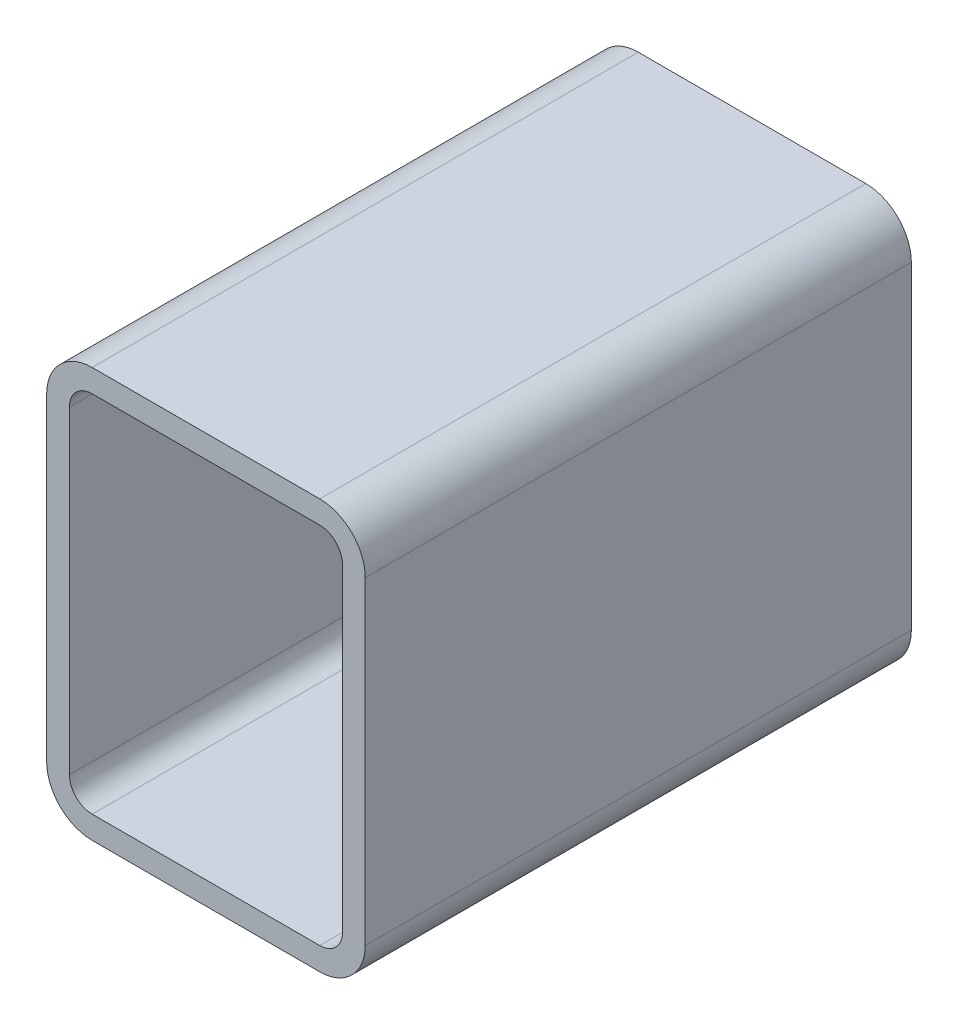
ISO-10303-21;
HEADER;
FILE_DESCRIPTION(('STEP AP214'),'2;1');
FILE_NAME('part.step','',(''),(''),'','','');
FILE_SCHEMA(('AUTOMOTIVE_DESIGN { 1 0 10303 214 1 1 1 1 }'));
ENDSEC;
DATA;
#1=APPLICATION_CONTEXT('core data for automotive mechanical design processes');
#2=APPLICATION_PROTOCOL_DEFINITION('international standard','automotive_design',2000,#1);
#3=PRODUCT_CONTEXT('',#1,'mechanical');
#4=PRODUCT('Part','Part','',(#3));
#5=PRODUCT_RELATED_PRODUCT_CATEGORY('part','',(#4));
#6=PRODUCT_DEFINITION_FORMATION('','',#4);
#7=PRODUCT_DEFINITION_CONTEXT('part definition',#1,'design');
#8=PRODUCT_DEFINITION('design','',#6,#7);
#9=PRODUCT_DEFINITION_SHAPE('','',#8);
#10=(LENGTH_UNIT() NAMED_UNIT(*) SI_UNIT(.MILLI.,.METRE.));
#11=(NAMED_UNIT(*) PLANE_ANGLE_UNIT() SI_UNIT($,.RADIAN.));
#12=(NAMED_UNIT(*) SI_UNIT($,.STERADIAN.) SOLID_ANGLE_UNIT());
#13=UNCERTAINTY_MEASURE_WITH_UNIT(LENGTH_MEASURE(1.E-05),#10,'distance_accuracy_value','');
#14=(GEOMETRIC_REPRESENTATION_CONTEXT(3) GLOBAL_UNCERTAINTY_ASSIGNED_CONTEXT((#13)) GLOBAL_UNIT_ASSIGNED_CONTEXT((#10,
#11,#12)) REPRESENTATION_CONTEXT('',''));
#15=CARTESIAN_POINT('',(0.,0.,0.));
#16=DIRECTION('',(0.,0.,1.));
#17=DIRECTION('',(1.,0.,0.));
#18=AXIS2_PLACEMENT_3D('',#15,#16,#17);
#19=CARTESIAN_POINT('',(27.6048786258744,205.143222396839,304.8));
#20=DIRECTION('',(0.,0.,1.));
#21=DIRECTION('',(1.,0.,0.));
#22=AXIS2_PLACEMENT_3D('',#19,#20,#21);
#23=PLANE('',#22);
#24=CARTESIAN_POINT('',(27.6048786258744,205.143222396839,304.8));
#25=DIRECTION('',(0.,0.,1.));
#26=DIRECTION('',(1.,0.,0.));
#27=AXIS2_PLACEMENT_3D('',#24,#25,#26);
#28=CIRCLE('',#27,25.4);
#29=CARTESIAN_POINT('',(27.6048786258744,230.543222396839,304.8));
#30=VERTEX_POINT('',#29);
#31=CARTESIAN_POINT('',(2.20487862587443,205.143222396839,304.8));
#32=VERTEX_POINT('',#31);
#33=EDGE_CURVE('E211',#30,#32,#28,.T.);
#34=ORIENTED_EDGE('',*,*,#33,.T.);
#35=DIRECTION('',(0.,-1.,0.));
#36=VECTOR('',#35,1.);
#37=CARTESIAN_POINT('',(2.20487862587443,27.3432223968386,304.8));
#38=LINE('',#37,#36);
#39=CARTESIAN_POINT('',(2.20487862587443,27.3432223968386,304.8));
#40=VERTEX_POINT('',#39);
#41=EDGE_CURVE('E214',#32,#40,#38,.T.);
#42=ORIENTED_EDGE('',*,*,#41,.T.);
#43=CARTESIAN_POINT('',(27.6048786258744,27.3432223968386,304.8));
#44=DIRECTION('',(0.,0.,1.));
#45=DIRECTION('',(1.,0.,0.));
#46=AXIS2_PLACEMENT_3D('',#43,#44,#45);
#47=CIRCLE('',#46,25.4);
#48=CARTESIAN_POINT('',(27.6048786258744,1.94322239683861,304.8));
#49=VERTEX_POINT('',#48);
#50=EDGE_CURVE('E217',#40,#49,#47,.T.);
#51=ORIENTED_EDGE('',*,*,#50,.T.);
#52=DIRECTION('',(1.,0.,0.));
#53=VECTOR('',#52,1.);
#54=CARTESIAN_POINT('',(154.604878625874,1.94322239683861,304.8));
#55=LINE('',#54,#53);
#56=CARTESIAN_POINT('',(154.604878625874,1.94322239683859,304.8));
#57=VERTEX_POINT('',#56);
#58=EDGE_CURVE('E219',#49,#57,#55,.T.);
#59=ORIENTED_EDGE('',*,*,#58,.T.);
#60=CARTESIAN_POINT('',(154.604878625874,27.3432223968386,304.8));
#61=DIRECTION('',(0.,0.,1.));
#62=DIRECTION('',(1.,0.,0.));
#63=AXIS2_PLACEMENT_3D('',#60,#61,#62);
#64=CIRCLE('',#63,25.4);
#65=CARTESIAN_POINT('',(180.004878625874,27.3432223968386,304.8));
#66=VERTEX_POINT('',#65);
#67=EDGE_CURVE('E221',#57,#66,#64,.T.);
#68=ORIENTED_EDGE('',*,*,#67,.T.);
#69=DIRECTION('',(0.,1.,0.));
#70=VECTOR('',#69,1.);
#71=CARTESIAN_POINT('',(180.004878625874,205.143222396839,304.8));
#72=LINE('',#71,#70);
#73=CARTESIAN_POINT('',(180.004878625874,205.143222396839,304.8));
#74=VERTEX_POINT('',#73);
#75=EDGE_CURVE('E223',#66,#74,#72,.T.);
#76=ORIENTED_EDGE('',*,*,#75,.T.);
#77=CARTESIAN_POINT('',(154.604878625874,205.143222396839,304.8));
#78=DIRECTION('',(0.,0.,1.));
#79=DIRECTION('',(1.,0.,0.));
#80=AXIS2_PLACEMENT_3D('',#77,#78,#79);
#81=CIRCLE('',#80,25.4);
#82=CARTESIAN_POINT('',(154.604878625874,230.543222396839,304.8));
#83=VERTEX_POINT('',#82);
#84=EDGE_CURVE('E225',#74,#83,#81,.T.);
#85=ORIENTED_EDGE('',*,*,#84,.T.);
#86=DIRECTION('',(-1.,0.,0.));
#87=VECTOR('',#86,1.);
#88=CARTESIAN_POINT('',(27.6048786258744,230.543222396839,304.8));
#89=LINE('',#88,#87);
#90=EDGE_CURVE('E227',#83,#30,#89,.T.);
#91=ORIENTED_EDGE('',*,*,#90,.T.);
#92=EDGE_LOOP('',(#34,#42,#51,#59,#68,#76,#85,#91));
#93=FACE_BOUND('',#92,.T.);
#94=DIRECTION('',(0.,-1.,0.));
#95=VECTOR('',#94,1.);
#96=CARTESIAN_POINT('',(14.9048786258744,27.3432223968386,304.8));
#97=LINE('',#96,#95);
#98=CARTESIAN_POINT('',(14.9048786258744,205.143222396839,304.8));
#99=VERTEX_POINT('',#98);
#100=CARTESIAN_POINT('',(14.9048786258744,27.3432223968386,304.8));
#101=VERTEX_POINT('',#100);
#102=EDGE_CURVE('E154',#99,#101,#97,.T.);
#103=ORIENTED_EDGE('',*,*,#102,.F.);
#104=CARTESIAN_POINT('',(27.6048786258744,205.143222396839,304.8));
#105=DIRECTION('',(0.,0.,1.));
#106=DIRECTION('',(1.,0.,0.));
#107=AXIS2_PLACEMENT_3D('',#104,#105,#106);
#108=CIRCLE('',#107,12.7);
#109=CARTESIAN_POINT('',(27.6048786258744,217.843222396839,304.8));
#110=VERTEX_POINT('',#109);
#111=EDGE_CURVE('E146',#110,#99,#108,.T.);
#112=ORIENTED_EDGE('',*,*,#111,.F.);
#113=DIRECTION('',(-1.,0.,0.));
#114=VECTOR('',#113,1.);
#115=CARTESIAN_POINT('',(27.6048786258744,217.843222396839,304.8));
#116=LINE('',#115,#114);
#117=CARTESIAN_POINT('',(154.604878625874,217.843222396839,304.8));
#118=VERTEX_POINT('',#117);
#119=EDGE_CURVE('E179',#118,#110,#116,.T.);
#120=ORIENTED_EDGE('',*,*,#119,.F.);
#121=CARTESIAN_POINT('',(154.604878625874,205.143222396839,304.8));
#122=DIRECTION('',(0.,0.,1.));
#123=DIRECTION('',(1.,0.,0.));
#124=AXIS2_PLACEMENT_3D('',#121,#122,#123);
#125=CIRCLE('',#124,12.7);
#126=CARTESIAN_POINT('',(167.304878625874,205.143222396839,304.8));
#127=VERTEX_POINT('',#126);
#128=EDGE_CURVE('E177',#127,#118,#125,.T.);
#129=ORIENTED_EDGE('',*,*,#128,.F.);
#130=DIRECTION('',(0.,1.,0.));
#131=VECTOR('',#130,1.);
#132=CARTESIAN_POINT('',(167.304878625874,205.143222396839,304.8));
#133=LINE('',#132,#131);
#134=CARTESIAN_POINT('',(167.304878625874,27.3432223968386,304.8));
#135=VERTEX_POINT('',#134);
#136=EDGE_CURVE('E175',#135,#127,#133,.T.);
#137=ORIENTED_EDGE('',*,*,#136,.F.);
#138=CARTESIAN_POINT('',(154.604878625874,27.3432223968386,304.8));
#139=DIRECTION('',(0.,0.,1.));
#140=DIRECTION('',(1.,0.,0.));
#141=AXIS2_PLACEMENT_3D('',#138,#139,#140);
#142=CIRCLE('',#141,12.7);
#143=CARTESIAN_POINT('',(154.604878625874,14.6432223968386,304.8));
#144=VERTEX_POINT('',#143);
#145=EDGE_CURVE('E173',#144,#135,#142,.T.);
#146=ORIENTED_EDGE('',*,*,#145,.F.);
#147=DIRECTION('',(1.,0.,0.));
#148=VECTOR('',#147,1.);
#149=CARTESIAN_POINT('',(154.604878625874,14.6432223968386,304.8));
#150=LINE('',#149,#148);
#151=CARTESIAN_POINT('',(27.6048786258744,14.6432223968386,304.8));
#152=VERTEX_POINT('',#151);
#153=EDGE_CURVE('E169',#152,#144,#150,.T.);
#154=ORIENTED_EDGE('',*,*,#153,.F.);
#155=CARTESIAN_POINT('',(27.6048786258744,27.3432223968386,304.8));
#156=DIRECTION('',(0.,0.,1.));
#157=DIRECTION('',(1.,0.,0.));
#158=AXIS2_PLACEMENT_3D('',#155,#156,#157);
#159=CIRCLE('',#158,12.7);
#160=EDGE_CURVE('E167',#101,#152,#159,.T.);
#161=ORIENTED_EDGE('',*,*,#160,.F.);
#162=EDGE_LOOP('',(#103,#112,#120,#129,#137,#146,#154,#161));
#163=FACE_BOUND('',#162,.T.);
#164=ADVANCED_FACE('F33',(#93,#163),#23,.T.);
#165=CARTESIAN_POINT('',(27.6048786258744,205.143222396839,0.));
#166=DIRECTION('',(0.,0.,1.));
#167=DIRECTION('',(1.,0.,0.));
#168=AXIS2_PLACEMENT_3D('',#165,#166,#167);
#169=PLANE('',#168);
#170=CARTESIAN_POINT('',(27.6048786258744,205.143222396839,0.));
#171=DIRECTION('',(0.,0.,1.));
#172=DIRECTION('',(1.,0.,0.));
#173=AXIS2_PLACEMENT_3D('',#170,#171,#172);
#174=CIRCLE('',#173,25.4);
#175=CARTESIAN_POINT('',(27.6048786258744,230.543222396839,0.));
#176=VERTEX_POINT('',#175);
#177=CARTESIAN_POINT('',(2.20487862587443,205.143222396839,0.));
#178=VERTEX_POINT('',#177);
#179=EDGE_CURVE('E162',#176,#178,#174,.T.);
#180=ORIENTED_EDGE('',*,*,#179,.F.);
#181=DIRECTION('',(-1.,0.,0.));
#182=VECTOR('',#181,1.);
#183=CARTESIAN_POINT('',(27.6048786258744,230.543222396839,0.));
#184=LINE('',#183,#182);
#185=CARTESIAN_POINT('',(154.604878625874,230.543222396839,0.));
#186=VERTEX_POINT('',#185);
#187=EDGE_CURVE('E215',#186,#176,#184,.T.);
#188=ORIENTED_EDGE('',*,*,#187,.F.);
#189=CARTESIAN_POINT('',(154.604878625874,205.143222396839,0.));
#190=DIRECTION('',(0.,0.,1.));
#191=DIRECTION('',(1.,0.,0.));
#192=AXIS2_PLACEMENT_3D('',#189,#190,#191);
#193=CIRCLE('',#192,25.4);
#194=CARTESIAN_POINT('',(180.004878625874,205.143222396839,0.));
#195=VERTEX_POINT('',#194);
#196=EDGE_CURVE('E242',#195,#186,#193,.T.);
#197=ORIENTED_EDGE('',*,*,#196,.F.);
#198=DIRECTION('',(0.,1.,0.));
#199=VECTOR('',#198,1.);
#200=CARTESIAN_POINT('',(180.004878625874,205.143222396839,0.));
#201=LINE('',#200,#199);
#202=CARTESIAN_POINT('',(180.004878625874,27.3432223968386,0.));
#203=VERTEX_POINT('',#202);
#204=EDGE_CURVE('E240',#203,#195,#201,.T.);
#205=ORIENTED_EDGE('',*,*,#204,.F.);
#206=CARTESIAN_POINT('',(154.604878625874,27.3432223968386,0.));
#207=DIRECTION('',(0.,0.,1.));
#208=DIRECTION('',(1.,0.,0.));
#209=AXIS2_PLACEMENT_3D('',#206,#207,#208);
#210=CIRCLE('',#209,25.4);
#211=CARTESIAN_POINT('',(154.604878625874,1.94322239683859,0.));
#212=VERTEX_POINT('',#211);
#213=EDGE_CURVE('E238',#212,#203,#210,.T.);
#214=ORIENTED_EDGE('',*,*,#213,.F.);
#215=DIRECTION('',(1.,0.,0.));
#216=VECTOR('',#215,1.);
#217=CARTESIAN_POINT('',(154.604878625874,1.94322239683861,0.));
#218=LINE('',#217,#216);
#219=CARTESIAN_POINT('',(27.6048786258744,1.94322239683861,0.));
#220=VERTEX_POINT('',#219);
#221=EDGE_CURVE('E236',#220,#212,#218,.T.);
#222=ORIENTED_EDGE('',*,*,#221,.F.);
#223=CARTESIAN_POINT('',(27.6048786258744,27.3432223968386,0.));
#224=DIRECTION('',(0.,0.,1.));
#225=DIRECTION('',(1.,0.,0.));
#226=AXIS2_PLACEMENT_3D('',#223,#224,#225);
#227=CIRCLE('',#226,25.4);
#228=CARTESIAN_POINT('',(2.20487862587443,27.3432223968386,0.));
#229=VERTEX_POINT('',#228);
#230=EDGE_CURVE('E234',#229,#220,#227,.T.);
#231=ORIENTED_EDGE('',*,*,#230,.F.);
#232=DIRECTION('',(0.,-1.,0.));
#233=VECTOR('',#232,1.);
#234=CARTESIAN_POINT('',(2.20487862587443,27.3432223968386,0.));
#235=LINE('',#234,#233);
#236=EDGE_CURVE('E232',#178,#229,#235,.T.);
#237=ORIENTED_EDGE('',*,*,#236,.F.);
#238=EDGE_LOOP('',(#180,#188,#197,#205,#214,#222,#231,#237));
#239=FACE_BOUND('',#238,.T.);
#240=CARTESIAN_POINT('',(27.6048786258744,205.143222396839,0.));
#241=DIRECTION('',(0.,0.,1.));
#242=DIRECTION('',(1.,0.,0.));
#243=AXIS2_PLACEMENT_3D('',#240,#241,#242);
#244=CIRCLE('',#243,12.7);
#245=CARTESIAN_POINT('',(27.6048786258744,217.843222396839,0.));
#246=VERTEX_POINT('',#245);
#247=CARTESIAN_POINT('',(14.9048786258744,205.143222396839,0.));
#248=VERTEX_POINT('',#247);
#249=EDGE_CURVE('E56',#246,#248,#244,.T.);
#250=ORIENTED_EDGE('',*,*,#249,.T.);
#251=DIRECTION('',(0.,-1.,0.));
#252=VECTOR('',#251,1.);
#253=CARTESIAN_POINT('',(14.9048786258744,27.3432223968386,0.));
#254=LINE('',#253,#252);
#255=CARTESIAN_POINT('',(14.9048786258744,27.3432223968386,0.));
#256=VERTEX_POINT('',#255);
#257=EDGE_CURVE('E161',#248,#256,#254,.T.);
#258=ORIENTED_EDGE('',*,*,#257,.T.);
#259=CARTESIAN_POINT('',(27.6048786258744,27.3432223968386,0.));
#260=DIRECTION('',(0.,0.,1.));
#261=DIRECTION('',(1.,0.,0.));
#262=AXIS2_PLACEMENT_3D('',#259,#260,#261);
#263=CIRCLE('',#262,12.7);
#264=CARTESIAN_POINT('',(27.6048786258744,14.6432223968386,0.));
#265=VERTEX_POINT('',#264);
#266=EDGE_CURVE('E183',#256,#265,#263,.T.);
#267=ORIENTED_EDGE('',*,*,#266,.T.);
#268=DIRECTION('',(1.,0.,0.));
#269=VECTOR('',#268,1.);
#270=CARTESIAN_POINT('',(154.604878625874,14.6432223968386,0.));
#271=LINE('',#270,#269);
#272=CARTESIAN_POINT('',(154.604878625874,14.6432223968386,0.));
#273=VERTEX_POINT('',#272);
#274=EDGE_CURVE('E186',#265,#273,#271,.T.);
#275=ORIENTED_EDGE('',*,*,#274,.T.);
#276=CARTESIAN_POINT('',(154.604878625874,27.3432223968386,0.));
#277=DIRECTION('',(0.,0.,1.));
#278=DIRECTION('',(1.,0.,0.));
#279=AXIS2_PLACEMENT_3D('',#276,#277,#278);
#280=CIRCLE('',#279,12.7);
#281=CARTESIAN_POINT('',(167.304878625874,27.3432223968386,0.));
#282=VERTEX_POINT('',#281);
#283=EDGE_CURVE('E189',#273,#282,#280,.T.);
#284=ORIENTED_EDGE('',*,*,#283,.T.);
#285=DIRECTION('',(0.,1.,0.));
#286=VECTOR('',#285,1.);
#287=CARTESIAN_POINT('',(167.304878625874,205.143222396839,0.));
#288=LINE('',#287,#286);
#289=CARTESIAN_POINT('',(167.304878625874,205.143222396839,0.));
#290=VERTEX_POINT('',#289);
#291=EDGE_CURVE('E192',#282,#290,#288,.T.);
#292=ORIENTED_EDGE('',*,*,#291,.T.);
#293=CARTESIAN_POINT('',(154.604878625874,205.143222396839,0.));
#294=DIRECTION('',(0.,0.,1.));
#295=DIRECTION('',(1.,0.,0.));
#296=AXIS2_PLACEMENT_3D('',#293,#294,#295);
#297=CIRCLE('',#296,12.7);
#298=CARTESIAN_POINT('',(154.604878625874,217.843222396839,0.));
#299=VERTEX_POINT('',#298);
#300=EDGE_CURVE('E195',#290,#299,#297,.T.);
#301=ORIENTED_EDGE('',*,*,#300,.T.);
#302=DIRECTION('',(-1.,0.,0.));
#303=VECTOR('',#302,1.);
#304=CARTESIAN_POINT('',(27.6048786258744,217.843222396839,0.));
#305=LINE('',#304,#303);
#306=EDGE_CURVE('E155',#299,#246,#305,.T.);
#307=ORIENTED_EDGE('',*,*,#306,.T.);
#308=EDGE_LOOP('',(#250,#258,#267,#275,#284,#292,#301,#307));
#309=FACE_BOUND('',#308,.T.);
#310=ADVANCED_FACE('F272',(#239,#309),#169,.F.);
#311=CARTESIAN_POINT('',(27.6048786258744,205.143222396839,304.8));
#312=DIRECTION('',(0.,0.,-1.));
#313=DIRECTION('',(-1.,0.,0.));
#314=AXIS2_PLACEMENT_3D('',#311,#312,#313);
#315=CYLINDRICAL_SURFACE('',#314,25.4);
#316=ORIENTED_EDGE('',*,*,#179,.T.);
#317=DIRECTION('',(0.,0.,-1.));
#318=VECTOR('',#317,1.);
#319=CARTESIAN_POINT('',(2.20487862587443,205.143222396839,304.8));
#320=LINE('',#319,#318);
#321=EDGE_CURVE('E11',#32,#178,#320,.T.);
#322=ORIENTED_EDGE('',*,*,#321,.F.);
#323=ORIENTED_EDGE('',*,*,#33,.F.);
#324=DIRECTION('',(0.,0.,-1.));
#325=VECTOR('',#324,1.);
#326=CARTESIAN_POINT('',(27.6048786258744,230.543222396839,304.8));
#327=LINE('',#326,#325);
#328=EDGE_CURVE('E229',#30,#176,#327,.T.);
#329=ORIENTED_EDGE('',*,*,#328,.T.);
#330=EDGE_LOOP('',(#316,#322,#323,#329));
#331=FACE_BOUND('',#330,.T.);
#332=ADVANCED_FACE('F35',(#331),#315,.T.);
#333=CARTESIAN_POINT('',(2.20487862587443,27.3432223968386,304.8));
#334=DIRECTION('',(1.,0.,0.));
#335=DIRECTION('',(0.,0.,-1.));
#336=AXIS2_PLACEMENT_3D('',#333,#334,#335);
#337=PLANE('',#336);
#338=ORIENTED_EDGE('',*,*,#236,.T.);
#339=DIRECTION('',(0.,0.,-1.));
#340=VECTOR('',#339,1.);
#341=CARTESIAN_POINT('',(2.20487862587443,27.3432223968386,304.8));
#342=LINE('',#341,#340);
#343=EDGE_CURVE('E41',#40,#229,#342,.T.);
#344=ORIENTED_EDGE('',*,*,#343,.F.);
#345=ORIENTED_EDGE('',*,*,#41,.F.);
#346=ORIENTED_EDGE('',*,*,#321,.T.);
#347=EDGE_LOOP('',(#338,#344,#345,#346));
#348=FACE_BOUND('',#347,.T.);
#349=ADVANCED_FACE('F289',(#348),#337,.F.);
#350=CARTESIAN_POINT('',(27.6048786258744,27.3432223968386,304.8));
#351=DIRECTION('',(0.,0.,-1.));
#352=DIRECTION('',(-1.,0.,0.));
#353=AXIS2_PLACEMENT_3D('',#350,#351,#352);
#354=CYLINDRICAL_SURFACE('',#353,25.4);
#355=ORIENTED_EDGE('',*,*,#230,.T.);
#356=DIRECTION('',(0.,0.,-1.));
#357=VECTOR('',#356,1.);
#358=CARTESIAN_POINT('',(27.6048786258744,1.94322239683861,304.8));
#359=LINE('',#358,#357);
#360=EDGE_CURVE('E259',#49,#220,#359,.T.);
#361=ORIENTED_EDGE('',*,*,#360,.F.);
#362=ORIENTED_EDGE('',*,*,#50,.F.);
#363=ORIENTED_EDGE('',*,*,#343,.T.);
#364=EDGE_LOOP('',(#355,#361,#362,#363));
#365=FACE_BOUND('',#364,.T.);
#366=ADVANCED_FACE('F266',(#365),#354,.T.);
#367=CARTESIAN_POINT('',(154.604878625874,1.94322239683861,304.8));
#368=DIRECTION('',(0.,1.,0.));
#369=DIRECTION('',(0.,0.,1.));
#370=AXIS2_PLACEMENT_3D('',#367,#368,#369);
#371=PLANE('',#370);
#372=ORIENTED_EDGE('',*,*,#221,.T.);
#373=DIRECTION('',(0.,0.,-1.));
#374=VECTOR('',#373,1.);
#375=CARTESIAN_POINT('',(154.604878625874,1.94322239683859,304.8));
#376=LINE('',#375,#374);
#377=EDGE_CURVE('E256',#57,#212,#376,.T.);
#378=ORIENTED_EDGE('',*,*,#377,.F.);
#379=ORIENTED_EDGE('',*,*,#58,.F.);
#380=ORIENTED_EDGE('',*,*,#360,.T.);
#381=EDGE_LOOP('',(#372,#378,#379,#380));
#382=FACE_BOUND('',#381,.T.);
#383=ADVANCED_FACE('F278',(#382),#371,.F.);
#384=CARTESIAN_POINT('',(154.604878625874,27.3432223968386,304.8));
#385=DIRECTION('',(0.,0.,-1.));
#386=DIRECTION('',(-1.,0.,0.));
#387=AXIS2_PLACEMENT_3D('',#384,#385,#386);
#388=CYLINDRICAL_SURFACE('',#387,25.4);
#389=ORIENTED_EDGE('',*,*,#213,.T.);
#390=DIRECTION('',(0.,0.,-1.));
#391=VECTOR('',#390,1.);
#392=CARTESIAN_POINT('',(180.004878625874,27.3432223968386,304.8));
#393=LINE('',#392,#391);
#394=EDGE_CURVE('E253',#66,#203,#393,.T.);
#395=ORIENTED_EDGE('',*,*,#394,.F.);
#396=ORIENTED_EDGE('',*,*,#67,.F.);
#397=ORIENTED_EDGE('',*,*,#377,.T.);
#398=EDGE_LOOP('',(#389,#395,#396,#397));
#399=FACE_BOUND('',#398,.T.);
#400=ADVANCED_FACE('F282',(#399),#388,.T.);
#401=CARTESIAN_POINT('',(180.004878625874,205.143222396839,304.8));
#402=DIRECTION('',(-1.,0.,0.));
#403=DIRECTION('',(0.,0.,1.));
#404=AXIS2_PLACEMENT_3D('',#401,#402,#403);
#405=PLANE('',#404);
#406=ORIENTED_EDGE('',*,*,#204,.T.);
#407=DIRECTION('',(0.,0.,-1.));
#408=VECTOR('',#407,1.);
#409=CARTESIAN_POINT('',(180.004878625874,205.143222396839,304.8));
#410=LINE('',#409,#408);
#411=EDGE_CURVE('E250',#74,#195,#410,.T.);
#412=ORIENTED_EDGE('',*,*,#411,.F.);
#413=ORIENTED_EDGE('',*,*,#75,.F.);
#414=ORIENTED_EDGE('',*,*,#394,.T.);
#415=EDGE_LOOP('',(#406,#412,#413,#414));
#416=FACE_BOUND('',#415,.T.);
#417=ADVANCED_FACE('F302',(#416),#405,.F.);
#418=CARTESIAN_POINT('',(154.604878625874,205.143222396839,304.8));
#419=DIRECTION('',(0.,0.,-1.));
#420=DIRECTION('',(-1.,0.,0.));
#421=AXIS2_PLACEMENT_3D('',#418,#419,#420);
#422=CYLINDRICAL_SURFACE('',#421,25.4);
#423=ORIENTED_EDGE('',*,*,#196,.T.);
#424=DIRECTION('',(0.,0.,-1.));
#425=VECTOR('',#424,1.);
#426=CARTESIAN_POINT('',(154.604878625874,230.543222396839,304.8));
#427=LINE('',#426,#425);
#428=EDGE_CURVE('E247',#83,#186,#427,.T.);
#429=ORIENTED_EDGE('',*,*,#428,.F.);
#430=ORIENTED_EDGE('',*,*,#84,.F.);
#431=ORIENTED_EDGE('',*,*,#411,.T.);
#432=EDGE_LOOP('',(#423,#429,#430,#431));
#433=FACE_BOUND('',#432,.T.);
#434=ADVANCED_FACE('F300',(#433),#422,.T.);
#435=CARTESIAN_POINT('',(27.6048786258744,230.543222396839,304.8));
#436=DIRECTION('',(0.,-1.,0.));
#437=DIRECTION('',(0.,0.,-1.));
#438=AXIS2_PLACEMENT_3D('',#435,#436,#437);
#439=PLANE('',#438);
#440=ORIENTED_EDGE('',*,*,#187,.T.);
#441=ORIENTED_EDGE('',*,*,#328,.F.);
#442=ORIENTED_EDGE('',*,*,#90,.F.);
#443=ORIENTED_EDGE('',*,*,#428,.T.);
#444=EDGE_LOOP('',(#440,#441,#442,#443));
#445=FACE_BOUND('',#444,.T.);
#446=ADVANCED_FACE('F295',(#445),#439,.F.);
#447=CARTESIAN_POINT('',(27.6048786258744,205.143222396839,304.8));
#448=DIRECTION('',(0.,0.,-1.));
#449=DIRECTION('',(-1.,0.,0.));
#450=AXIS2_PLACEMENT_3D('',#447,#448,#449);
#451=CYLINDRICAL_SURFACE('',#450,12.7);
#452=ORIENTED_EDGE('',*,*,#249,.F.);
#453=DIRECTION('',(0.,0.,-1.));
#454=VECTOR('',#453,1.);
#455=CARTESIAN_POINT('',(27.6048786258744,217.843222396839,304.8));
#456=LINE('',#455,#454);
#457=EDGE_CURVE('E150',#110,#246,#456,.T.);
#458=ORIENTED_EDGE('',*,*,#457,.F.);
#459=ORIENTED_EDGE('',*,*,#111,.T.);
#460=DIRECTION('',(0.,0.,-1.));
#461=VECTOR('',#460,1.);
#462=CARTESIAN_POINT('',(14.9048786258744,205.143222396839,304.8));
#463=LINE('',#462,#461);
#464=EDGE_CURVE('E149',#99,#248,#463,.T.);
#465=ORIENTED_EDGE('',*,*,#464,.T.);
#466=EDGE_LOOP('',(#452,#458,#459,#465));
#467=FACE_BOUND('',#466,.T.);
#468=ADVANCED_FACE('F148',(#467),#451,.F.);
#469=CARTESIAN_POINT('',(14.9048786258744,27.3432223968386,304.8));
#470=DIRECTION('',(1.,0.,0.));
#471=DIRECTION('',(0.,0.,-1.));
#472=AXIS2_PLACEMENT_3D('',#469,#470,#471);
#473=PLANE('',#472);
#474=ORIENTED_EDGE('',*,*,#257,.F.);
#475=ORIENTED_EDGE('',*,*,#464,.F.);
#476=ORIENTED_EDGE('',*,*,#102,.T.);
#477=DIRECTION('',(0.,0.,-1.));
#478=VECTOR('',#477,1.);
#479=CARTESIAN_POINT('',(14.9048786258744,27.3432223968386,304.8));
#480=LINE('',#479,#478);
#481=EDGE_CURVE('E163',#101,#256,#480,.T.);
#482=ORIENTED_EDGE('',*,*,#481,.T.);
#483=EDGE_LOOP('',(#474,#475,#476,#482));
#484=FACE_BOUND('',#483,.T.);
#485=ADVANCED_FACE('F158',(#484),#473,.T.);
#486=CARTESIAN_POINT('',(27.6048786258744,27.3432223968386,304.8));
#487=DIRECTION('',(0.,0.,-1.));
#488=DIRECTION('',(-1.,0.,0.));
#489=AXIS2_PLACEMENT_3D('',#486,#487,#488);
#490=CYLINDRICAL_SURFACE('',#489,12.7);
#491=ORIENTED_EDGE('',*,*,#266,.F.);
#492=ORIENTED_EDGE('',*,*,#481,.F.);
#493=ORIENTED_EDGE('',*,*,#160,.T.);
#494=DIRECTION('',(0.,0.,-1.));
#495=VECTOR('',#494,1.);
#496=CARTESIAN_POINT('',(27.6048786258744,14.6432223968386,304.8));
#497=LINE('',#496,#495);
#498=EDGE_CURVE('E208',#152,#265,#497,.T.);
#499=ORIENTED_EDGE('',*,*,#498,.T.);
#500=EDGE_LOOP('',(#491,#492,#493,#499));
#501=FACE_BOUND('',#500,.T.);
#502=ADVANCED_FACE('F327',(#501),#490,.F.);
#503=CARTESIAN_POINT('',(154.604878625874,14.6432223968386,304.8));
#504=DIRECTION('',(0.,1.,0.));
#505=DIRECTION('',(0.,0.,1.));
#506=AXIS2_PLACEMENT_3D('',#503,#504,#505);
#507=PLANE('',#506);
#508=ORIENTED_EDGE('',*,*,#274,.F.);
#509=ORIENTED_EDGE('',*,*,#498,.F.);
#510=ORIENTED_EDGE('',*,*,#153,.T.);
#511=DIRECTION('',(0.,0.,-1.));
#512=VECTOR('',#511,1.);
#513=CARTESIAN_POINT('',(154.604878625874,14.6432223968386,304.8));
#514=LINE('',#513,#512);
#515=EDGE_CURVE('E206',#144,#273,#514,.T.);
#516=ORIENTED_EDGE('',*,*,#515,.T.);
#517=EDGE_LOOP('',(#508,#509,#510,#516));
#518=FACE_BOUND('',#517,.T.);
#519=ADVANCED_FACE('F331',(#518),#507,.T.);
#520=CARTESIAN_POINT('',(154.604878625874,27.3432223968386,304.8));
#521=DIRECTION('',(0.,0.,-1.));
#522=DIRECTION('',(-1.,0.,0.));
#523=AXIS2_PLACEMENT_3D('',#520,#521,#522);
#524=CYLINDRICAL_SURFACE('',#523,12.7);
#525=ORIENTED_EDGE('',*,*,#283,.F.);
#526=ORIENTED_EDGE('',*,*,#515,.F.);
#527=ORIENTED_EDGE('',*,*,#145,.T.);
#528=DIRECTION('',(0.,0.,-1.));
#529=VECTOR('',#528,1.);
#530=CARTESIAN_POINT('',(167.304878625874,27.3432223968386,304.8));
#531=LINE('',#530,#529);
#532=EDGE_CURVE('E204',#135,#282,#531,.T.);
#533=ORIENTED_EDGE('',*,*,#532,.T.);
#534=EDGE_LOOP('',(#525,#526,#527,#533));
#535=FACE_BOUND('',#534,.T.);
#536=ADVANCED_FACE('F337',(#535),#524,.F.);
#537=CARTESIAN_POINT('',(167.304878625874,205.143222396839,304.8));
#538=DIRECTION('',(-1.,0.,0.));
#539=DIRECTION('',(0.,0.,1.));
#540=AXIS2_PLACEMENT_3D('',#537,#538,#539);
#541=PLANE('',#540);
#542=ORIENTED_EDGE('',*,*,#291,.F.);
#543=ORIENTED_EDGE('',*,*,#532,.F.);
#544=ORIENTED_EDGE('',*,*,#136,.T.);
#545=DIRECTION('',(0.,0.,-1.));
#546=VECTOR('',#545,1.);
#547=CARTESIAN_POINT('',(167.304878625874,205.143222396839,304.8));
#548=LINE('',#547,#546);
#549=EDGE_CURVE('E202',#127,#290,#548,.T.);
#550=ORIENTED_EDGE('',*,*,#549,.T.);
#551=EDGE_LOOP('',(#542,#543,#544,#550));
#552=FACE_BOUND('',#551,.T.);
#553=ADVANCED_FACE('F341',(#552),#541,.T.);
#554=CARTESIAN_POINT('',(154.604878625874,205.143222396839,304.8));
#555=DIRECTION('',(0.,0.,-1.));
#556=DIRECTION('',(-1.,0.,0.));
#557=AXIS2_PLACEMENT_3D('',#554,#555,#556);
#558=CYLINDRICAL_SURFACE('',#557,12.7);
#559=ORIENTED_EDGE('',*,*,#300,.F.);
#560=ORIENTED_EDGE('',*,*,#549,.F.);
#561=ORIENTED_EDGE('',*,*,#128,.T.);
#562=DIRECTION('',(0.,0.,-1.));
#563=VECTOR('',#562,1.);
#564=CARTESIAN_POINT('',(154.604878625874,217.843222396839,304.8));
#565=LINE('',#564,#563);
#566=EDGE_CURVE('E48',#118,#299,#565,.T.);
#567=ORIENTED_EDGE('',*,*,#566,.T.);
#568=EDGE_LOOP('',(#559,#560,#561,#567));
#569=FACE_BOUND('',#568,.T.);
#570=ADVANCED_FACE('F345',(#569),#558,.F.);
#571=CARTESIAN_POINT('',(27.6048786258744,217.843222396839,304.8));
#572=DIRECTION('',(0.,-1.,0.));
#573=DIRECTION('',(0.,0.,-1.));
#574=AXIS2_PLACEMENT_3D('',#571,#572,#573);
#575=PLANE('',#574);
#576=ORIENTED_EDGE('',*,*,#306,.F.);
#577=ORIENTED_EDGE('',*,*,#566,.F.);
#578=ORIENTED_EDGE('',*,*,#119,.T.);
#579=ORIENTED_EDGE('',*,*,#457,.T.);
#580=EDGE_LOOP('',(#576,#577,#578,#579));
#581=FACE_BOUND('',#580,.T.);
#582=ADVANCED_FACE('F349',(#581),#575,.T.);
#583=CLOSED_SHELL('',(#164,#310,#332,#349,#366,#383,#400,#417,#434,#446,#468,#485,#502,#519,
#536,#553,#570,#582));
#584=MANIFOLD_SOLID_BREP('B2',#583);
#585=ADVANCED_BREP_SHAPE_REPRESENTATION('',(#18,#584),#14);
#586=SHAPE_DEFINITION_REPRESENTATION(#9,#585);
ENDSEC;
END-ISO-10303-21;
